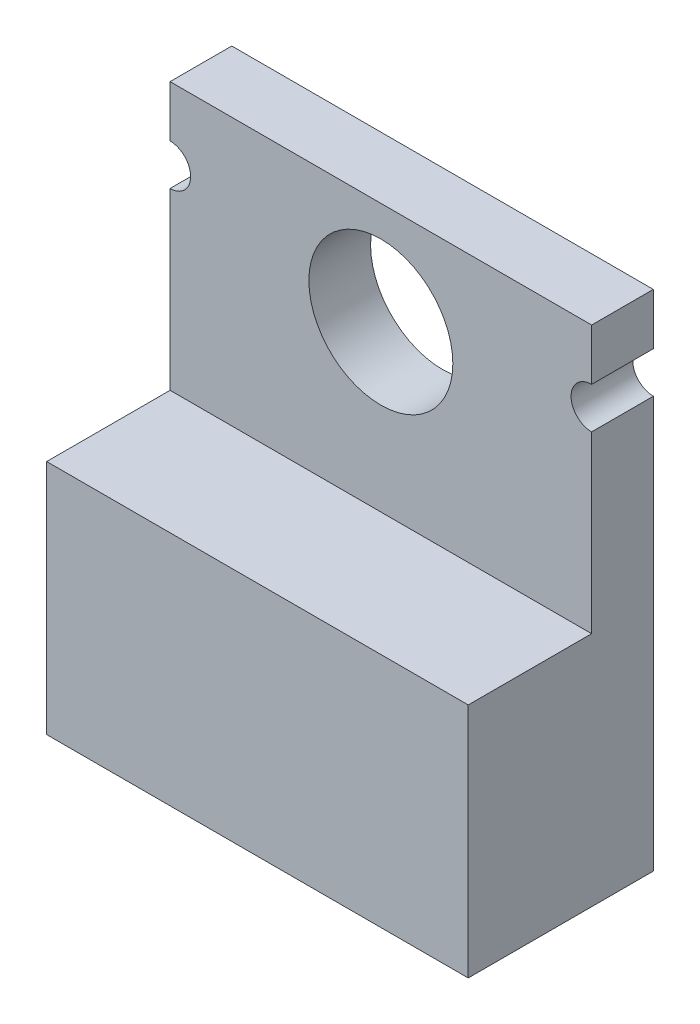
from build123d import *

# Parameters (mm, degrees)
SKETCH1_R           = 1.778
BASE_EXTRUDE_DEPTH  = 1.524
SKETCH2_W           = 10.414
SKETCH2_H           = 5.842
BOSS_EXTRUDE1_DEPTH = 3.048


with BuildPart() as part:
    # Sketch1 → Base-Extrude (new body)
    with BuildSketch(Plane.XY):
        with BuildLine():
            Line((0, 0), (10.414, 0))
            Line((10.414, 0), (10.414, 10.16))
            ThreePointArc((10.414, 10.16), (9.906, 10.668), (10.414, 11.176))
            Line((10.414, 11.176), (10.414, 12.446))
            Line((10.414, 12.446), (0, 12.446))
            Line((0, 12.446), (0, 11.176))
            ThreePointArc((0, 11.176), (0.508, 10.668), (0, 10.16))
            Line((0, 10.16), (0, 0))
        make_face()
        with Locations(Location((5.207, 9.906, 0), (0, 0, 180))):
            Circle(SKETCH1_R, mode=Mode.SUBTRACT)
    extrude(amount=BASE_EXTRUDE_DEPTH)

    # Sketch2 → Boss-Extrude1 (add)
    with BuildSketch(Plane.XY.offset(1.524)):
        with Locations((5.207, 2.921)):
            Rectangle(SKETCH2_W, SKETCH2_H)
    extrude(amount=BOSS_EXTRUDE1_DEPTH)


solid = part.part
